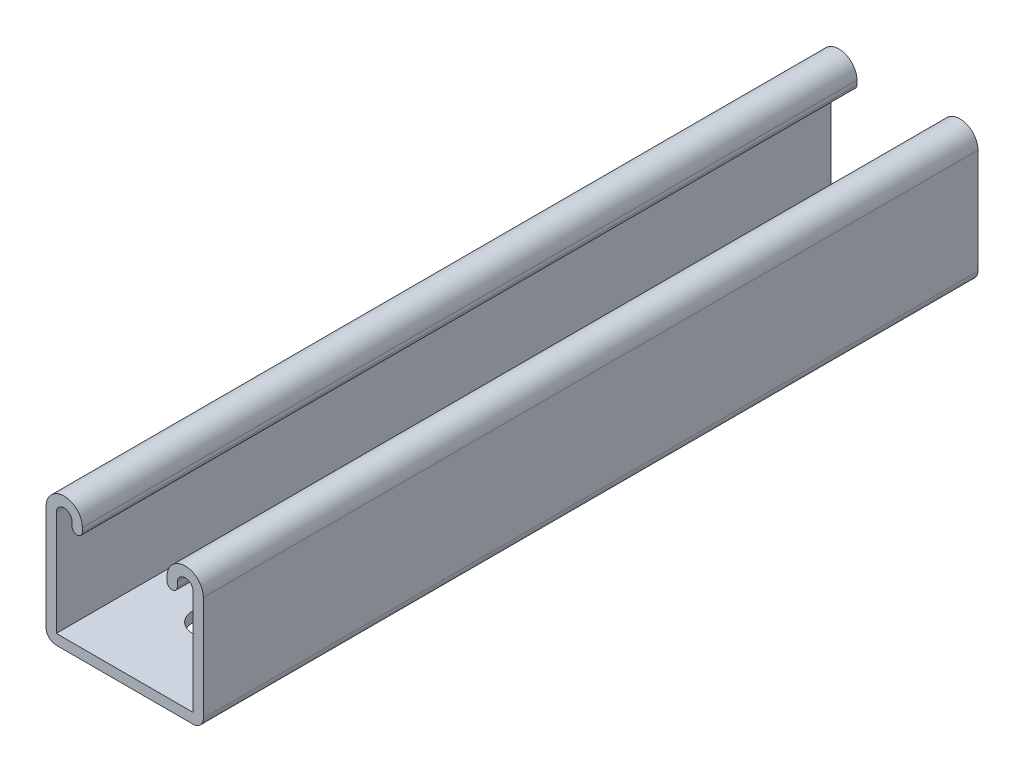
ISO-10303-21;
HEADER;
FILE_DESCRIPTION(('STEP AP214'),'2;1');
FILE_NAME('part.step','',(''),(''),'','','');
FILE_SCHEMA(('AUTOMOTIVE_DESIGN { 1 0 10303 214 1 1 1 1 }'));
ENDSEC;
DATA;
#1=APPLICATION_CONTEXT('core data for automotive mechanical design processes');
#2=APPLICATION_PROTOCOL_DEFINITION('international standard','automotive_design',2000,#1);
#3=PRODUCT_CONTEXT('',#1,'mechanical');
#4=PRODUCT('Part','Part','',(#3));
#5=PRODUCT_RELATED_PRODUCT_CATEGORY('part','',(#4));
#6=PRODUCT_DEFINITION_FORMATION('','',#4);
#7=PRODUCT_DEFINITION_CONTEXT('part definition',#1,'design');
#8=PRODUCT_DEFINITION('design','',#6,#7);
#9=PRODUCT_DEFINITION_SHAPE('','',#8);
#10=(LENGTH_UNIT() NAMED_UNIT(*) SI_UNIT(.MILLI.,.METRE.));
#11=(NAMED_UNIT(*) PLANE_ANGLE_UNIT() SI_UNIT($,.RADIAN.));
#12=(NAMED_UNIT(*) SI_UNIT($,.STERADIAN.) SOLID_ANGLE_UNIT());
#13=UNCERTAINTY_MEASURE_WITH_UNIT(LENGTH_MEASURE(1.E-05),#10,'distance_accuracy_value','');
#14=(GEOMETRIC_REPRESENTATION_CONTEXT(3) GLOBAL_UNCERTAINTY_ASSIGNED_CONTEXT((#13)) GLOBAL_UNIT_ASSIGNED_CONTEXT((#10,
#11,#12)) REPRESENTATION_CONTEXT('',''));
#15=CARTESIAN_POINT('',(0.,0.,0.));
#16=DIRECTION('',(0.,0.,1.));
#17=DIRECTION('',(1.,0.,0.));
#18=AXIS2_PLACEMENT_3D('',#15,#16,#17);
#19=CARTESIAN_POINT('',(-15.875,15.1511,203.2));
#20=DIRECTION('',(0.,0.,-1.));
#21=DIRECTION('',(-1.,0.,0.));
#22=AXIS2_PLACEMENT_3D('',#19,#20,#21);
#23=CYLINDRICAL_SURFACE('',#22,4.7625);
#24=CARTESIAN_POINT('',(-15.875,15.1511,0.));
#25=DIRECTION('',(0.,0.,1.));
#26=DIRECTION('',(-1.,0.,0.));
#27=AXIS2_PLACEMENT_3D('',#24,#25,#26);
#28=CIRCLE('',#27,4.7625);
#29=CARTESIAN_POINT('',(-11.1125,15.1511,0.));
#30=VERTEX_POINT('',#29);
#31=CARTESIAN_POINT('',(-20.6375,15.1511,0.));
#32=VERTEX_POINT('',#31);
#33=EDGE_CURVE('E260',#30,#32,#28,.T.);
#34=ORIENTED_EDGE('',*,*,#33,.T.);
#35=DIRECTION('',(0.,0.,-1.));
#36=VECTOR('',#35,1.);
#37=CARTESIAN_POINT('',(-20.6375,15.1511,203.2));
#38=LINE('',#37,#36);
#39=CARTESIAN_POINT('',(-20.6375,15.1511,203.2));
#40=VERTEX_POINT('',#39);
#41=EDGE_CURVE('E391',#40,#32,#38,.T.);
#42=ORIENTED_EDGE('',*,*,#41,.F.);
#43=CARTESIAN_POINT('',(-15.875,15.1511,203.2));
#44=DIRECTION('',(0.,0.,1.));
#45=DIRECTION('',(-1.,0.,0.));
#46=AXIS2_PLACEMENT_3D('',#43,#44,#45);
#47=CIRCLE('',#46,4.7625);
#48=CARTESIAN_POINT('',(-11.1125,15.1511,203.2));
#49=VERTEX_POINT('',#48);
#50=EDGE_CURVE('E267',#49,#40,#47,.T.);
#51=ORIENTED_EDGE('',*,*,#50,.F.);
#52=DIRECTION('',(0.,0.,-1.));
#53=VECTOR('',#52,1.);
#54=CARTESIAN_POINT('',(-11.1125,15.1511,203.2));
#55=LINE('',#54,#53);
#56=EDGE_CURVE('E305',#49,#30,#55,.T.);
#57=ORIENTED_EDGE('',*,*,#56,.T.);
#58=EDGE_LOOP('',(#34,#42,#51,#57));
#59=FACE_BOUND('',#58,.T.);
#60=ADVANCED_FACE('F39',(#59),#23,.T.);
#61=CARTESIAN_POINT('',(-20.6375,15.1511,203.2));
#62=DIRECTION('',(1.,0.,0.));
#63=DIRECTION('',(0.,1.,0.));
#64=AXIS2_PLACEMENT_3D('',#61,#62,#63);
#65=PLANE('',#64);
#66=DIRECTION('',(0.,-1.,0.));
#67=VECTOR('',#66,1.);
#68=CARTESIAN_POINT('',(-20.6375,15.1511,0.));
#69=LINE('',#68,#67);
#70=CARTESIAN_POINT('',(-20.6375,-12.319,0.));
#71=VERTEX_POINT('',#70);
#72=EDGE_CURVE('E308',#32,#71,#69,.T.);
#73=ORIENTED_EDGE('',*,*,#72,.T.);
#74=DIRECTION('',(0.,0.,-1.));
#75=VECTOR('',#74,1.);
#76=CARTESIAN_POINT('',(-20.6375,-12.319,203.2));
#77=LINE('',#76,#75);
#78=CARTESIAN_POINT('',(-20.6375,-12.319,203.2));
#79=VERTEX_POINT('',#78);
#80=EDGE_CURVE('E388',#79,#71,#77,.T.);
#81=ORIENTED_EDGE('',*,*,#80,.F.);
#82=DIRECTION('',(0.,-1.,0.));
#83=VECTOR('',#82,1.);
#84=CARTESIAN_POINT('',(-20.6375,15.1511,203.2));
#85=LINE('',#84,#83);
#86=EDGE_CURVE('E270',#40,#79,#85,.T.);
#87=ORIENTED_EDGE('',*,*,#86,.F.);
#88=ORIENTED_EDGE('',*,*,#41,.T.);
#89=EDGE_LOOP('',(#73,#81,#87,#88));
#90=FACE_BOUND('',#89,.T.);
#91=ADVANCED_FACE('F433',(#90),#65,.F.);
#92=CARTESIAN_POINT('',(-17.9451,-12.319,203.2));
#93=DIRECTION('',(0.,0.,-1.));
#94=DIRECTION('',(-1.,0.,0.));
#95=AXIS2_PLACEMENT_3D('',#92,#93,#94);
#96=CYLINDRICAL_SURFACE('',#95,2.6924);
#97=CARTESIAN_POINT('',(-17.9451,-12.319,0.));
#98=DIRECTION('',(0.,0.,1.));
#99=DIRECTION('',(-1.,0.,0.));
#100=AXIS2_PLACEMENT_3D('',#97,#98,#99);
#101=CIRCLE('',#100,2.6924);
#102=CARTESIAN_POINT('',(-17.9451,-15.0114,0.));
#103=VERTEX_POINT('',#102);
#104=EDGE_CURVE('E310',#71,#103,#101,.T.);
#105=ORIENTED_EDGE('',*,*,#104,.T.);
#106=DIRECTION('',(0.,0.,-1.));
#107=VECTOR('',#106,1.);
#108=CARTESIAN_POINT('',(-17.9451,-15.0114,203.2));
#109=LINE('',#108,#107);
#110=CARTESIAN_POINT('',(-17.9451,-15.0114,203.2));
#111=VERTEX_POINT('',#110);
#112=EDGE_CURVE('E385',#111,#103,#109,.T.);
#113=ORIENTED_EDGE('',*,*,#112,.F.);
#114=CARTESIAN_POINT('',(-17.9451,-12.319,203.2));
#115=DIRECTION('',(0.,0.,1.));
#116=DIRECTION('',(-1.,0.,0.));
#117=AXIS2_PLACEMENT_3D('',#114,#115,#116);
#118=CIRCLE('',#117,2.6924);
#119=EDGE_CURVE('E273',#79,#111,#118,.T.);
#120=ORIENTED_EDGE('',*,*,#119,.F.);
#121=ORIENTED_EDGE('',*,*,#80,.T.);
#122=EDGE_LOOP('',(#105,#113,#120,#121));
#123=FACE_BOUND('',#122,.T.);
#124=ADVANCED_FACE('F438',(#123),#96,.T.);
#125=CARTESIAN_POINT('',(-17.9451,-15.0114,203.2));
#126=DIRECTION('',(0.,1.,0.));
#127=DIRECTION('',(-1.,0.,0.));
#128=AXIS2_PLACEMENT_3D('',#125,#126,#127);
#129=PLANE('',#128);
#130=DIRECTION('',(0.,0.,-1.));
#131=VECTOR('',#130,1.);
#132=CARTESIAN_POINT('',(-5.159375,-15.0113999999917,114.3));
#133=LINE('',#132,#131);
#134=CARTESIAN_POINT('',(-5.15937500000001,-15.0114,180.18125));
#135=VERTEX_POINT('',#134);
#136=CARTESIAN_POINT('',(-5.159375,-15.0113999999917,114.3));
#137=VERTEX_POINT('',#136);
#138=EDGE_CURVE('E213',#135,#137,#133,.T.);
#139=ORIENTED_EDGE('',*,*,#138,.F.);
#140=CARTESIAN_POINT('',(0.,-15.0113999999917,180.18125));
#141=DIRECTION('',(0.,-1.,0.));
#142=DIRECTION('',(1.,0.,0.));
#143=AXIS2_PLACEMENT_3D('',#140,#141,#142);
#144=CIRCLE('',#143,5.159375);
#145=CARTESIAN_POINT('',(5.159375,-15.0113999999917,180.18125));
#146=VERTEX_POINT('',#145);
#147=EDGE_CURVE('E53',#146,#135,#144,.T.);
#148=ORIENTED_EDGE('',*,*,#147,.F.);
#149=DIRECTION('',(0.,0.,1.));
#150=VECTOR('',#149,1.);
#151=CARTESIAN_POINT('',(5.159375,-15.0113999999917,180.18125));
#152=LINE('',#151,#150);
#153=CARTESIAN_POINT('',(5.159375,-15.0113999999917,114.3));
#154=VERTEX_POINT('',#153);
#155=EDGE_CURVE('E229',#154,#146,#152,.T.);
#156=ORIENTED_EDGE('',*,*,#155,.F.);
#157=CARTESIAN_POINT('',(0.,-15.0113999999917,114.3));
#158=DIRECTION('',(0.,-1.,0.));
#159=DIRECTION('',(1.,0.,0.));
#160=AXIS2_PLACEMENT_3D('',#157,#158,#159);
#161=CIRCLE('',#160,5.159375);
#162=EDGE_CURVE('E223',#137,#154,#161,.T.);
#163=ORIENTED_EDGE('',*,*,#162,.F.);
#164=EDGE_LOOP('',(#139,#148,#156,#163));
#165=FACE_BOUND('',#164,.T.);
#166=DIRECTION('',(0.,0.,-1.));
#167=VECTOR('',#166,1.);
#168=CARTESIAN_POINT('',(-5.159375,-15.0113999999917,12.7));
#169=LINE('',#168,#167);
#170=CARTESIAN_POINT('',(-5.15937500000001,-15.0114,78.58125));
#171=VERTEX_POINT('',#170);
#172=CARTESIAN_POINT('',(-5.159375,-15.0113999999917,12.7));
#173=VERTEX_POINT('',#172);
#174=EDGE_CURVE('E248',#171,#173,#169,.T.);
#175=ORIENTED_EDGE('',*,*,#174,.F.);
#176=CARTESIAN_POINT('',(0.,-15.0113999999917,78.58125));
#177=DIRECTION('',(0.,-1.,0.));
#178=DIRECTION('',(1.,0.,0.));
#179=AXIS2_PLACEMENT_3D('',#176,#177,#178);
#180=CIRCLE('',#179,5.159375);
#181=CARTESIAN_POINT('',(5.159375,-15.0113999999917,78.58125));
#182=VERTEX_POINT('',#181);
#183=EDGE_CURVE('E246',#182,#171,#180,.T.);
#184=ORIENTED_EDGE('',*,*,#183,.F.);
#185=DIRECTION('',(0.,0.,1.));
#186=VECTOR('',#185,1.);
#187=CARTESIAN_POINT('',(5.159375,-15.0113999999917,78.58125));
#188=LINE('',#187,#186);
#189=CARTESIAN_POINT('',(5.159375,-15.0113999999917,12.7));
#190=VERTEX_POINT('',#189);
#191=EDGE_CURVE('E254',#190,#182,#188,.T.);
#192=ORIENTED_EDGE('',*,*,#191,.F.);
#193=CARTESIAN_POINT('',(0.,-15.0113999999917,12.7));
#194=DIRECTION('',(0.,-1.,0.));
#195=DIRECTION('',(1.,0.,0.));
#196=AXIS2_PLACEMENT_3D('',#193,#194,#195);
#197=CIRCLE('',#196,5.159375);
#198=EDGE_CURVE('E251',#173,#190,#197,.T.);
#199=ORIENTED_EDGE('',*,*,#198,.F.);
#200=EDGE_LOOP('',(#175,#184,#192,#199));
#201=FACE_BOUND('',#200,.T.);
#202=DIRECTION('',(1.,0.,0.));
#203=VECTOR('',#202,1.);
#204=CARTESIAN_POINT('',(-17.9451,-15.0114,0.));
#205=LINE('',#204,#203);
#206=CARTESIAN_POINT('',(17.9451,-15.0114,0.));
#207=VERTEX_POINT('',#206);
#208=EDGE_CURVE('E312',#103,#207,#205,.T.);
#209=ORIENTED_EDGE('',*,*,#208,.T.);
#210=DIRECTION('',(0.,0.,-1.));
#211=VECTOR('',#210,1.);
#212=CARTESIAN_POINT('',(17.9451,-15.0114,203.2));
#213=LINE('',#212,#211);
#214=CARTESIAN_POINT('',(17.9451,-15.0114,203.2));
#215=VERTEX_POINT('',#214);
#216=EDGE_CURVE('E382',#215,#207,#213,.T.);
#217=ORIENTED_EDGE('',*,*,#216,.F.);
#218=DIRECTION('',(1.,0.,0.));
#219=VECTOR('',#218,1.);
#220=CARTESIAN_POINT('',(-17.9451,-15.0114,203.2));
#221=LINE('',#220,#219);
#222=EDGE_CURVE('E275',#111,#215,#221,.T.);
#223=ORIENTED_EDGE('',*,*,#222,.F.);
#224=ORIENTED_EDGE('',*,*,#112,.T.);
#225=EDGE_LOOP('',(#209,#217,#223,#224));
#226=FACE_BOUND('',#225,.T.);
#227=ADVANCED_FACE('F227',(#165,#201,#226),#129,.F.);
#228=CARTESIAN_POINT('',(17.9451,-12.319,203.2));
#229=DIRECTION('',(0.,0.,-1.));
#230=DIRECTION('',(-1.,0.,0.));
#231=AXIS2_PLACEMENT_3D('',#228,#229,#230);
#232=CYLINDRICAL_SURFACE('',#231,2.6924);
#233=CARTESIAN_POINT('',(17.9451,-12.319,0.));
#234=DIRECTION('',(0.,0.,1.));
#235=DIRECTION('',(1.,0.,0.));
#236=AXIS2_PLACEMENT_3D('',#233,#234,#235);
#237=CIRCLE('',#236,2.6924);
#238=CARTESIAN_POINT('',(20.6375,-12.319,0.));
#239=VERTEX_POINT('',#238);
#240=EDGE_CURVE('E314',#207,#239,#237,.T.);
#241=ORIENTED_EDGE('',*,*,#240,.T.);
#242=DIRECTION('',(0.,0.,-1.));
#243=VECTOR('',#242,1.);
#244=CARTESIAN_POINT('',(20.6375,-12.319,203.2));
#245=LINE('',#244,#243);
#246=CARTESIAN_POINT('',(20.6375,-12.319,203.2));
#247=VERTEX_POINT('',#246);
#248=EDGE_CURVE('E379',#247,#239,#245,.T.);
#249=ORIENTED_EDGE('',*,*,#248,.F.);
#250=CARTESIAN_POINT('',(17.9451,-12.319,203.2));
#251=DIRECTION('',(0.,0.,1.));
#252=DIRECTION('',(1.,0.,0.));
#253=AXIS2_PLACEMENT_3D('',#250,#251,#252);
#254=CIRCLE('',#253,2.6924);
#255=EDGE_CURVE('E277',#215,#247,#254,.T.);
#256=ORIENTED_EDGE('',*,*,#255,.F.);
#257=ORIENTED_EDGE('',*,*,#216,.T.);
#258=EDGE_LOOP('',(#241,#249,#256,#257));
#259=FACE_BOUND('',#258,.T.);
#260=ADVANCED_FACE('F518',(#259),#232,.T.);
#261=CARTESIAN_POINT('',(20.6375,-12.319,203.2));
#262=DIRECTION('',(-1.,0.,0.));
#263=DIRECTION('',(0.,0.,1.));
#264=AXIS2_PLACEMENT_3D('',#261,#262,#263);
#265=PLANE('',#264);
#266=DIRECTION('',(0.,1.,0.));
#267=VECTOR('',#266,1.);
#268=CARTESIAN_POINT('',(20.6375,-12.319,0.));
#269=LINE('',#268,#267);
#270=CARTESIAN_POINT('',(20.6375,15.1511,0.));
#271=VERTEX_POINT('',#270);
#272=EDGE_CURVE('E316',#239,#271,#269,.T.);
#273=ORIENTED_EDGE('',*,*,#272,.T.);
#274=DIRECTION('',(0.,0.,-1.));
#275=VECTOR('',#274,1.);
#276=CARTESIAN_POINT('',(20.6375,15.1511,203.2));
#277=LINE('',#276,#275);
#278=CARTESIAN_POINT('',(20.6375,15.1511,203.2));
#279=VERTEX_POINT('',#278);
#280=EDGE_CURVE('E376',#279,#271,#277,.T.);
#281=ORIENTED_EDGE('',*,*,#280,.F.);
#282=DIRECTION('',(0.,1.,0.));
#283=VECTOR('',#282,1.);
#284=CARTESIAN_POINT('',(20.6375,-12.319,203.2));
#285=LINE('',#284,#283);
#286=EDGE_CURVE('E279',#247,#279,#285,.T.);
#287=ORIENTED_EDGE('',*,*,#286,.F.);
#288=ORIENTED_EDGE('',*,*,#248,.T.);
#289=EDGE_LOOP('',(#273,#281,#287,#288));
#290=FACE_BOUND('',#289,.T.);
#291=ADVANCED_FACE('F514',(#290),#265,.F.);
#292=CARTESIAN_POINT('',(15.875,15.1511,203.2));
#293=DIRECTION('',(0.,0.,-1.));
#294=DIRECTION('',(-1.,0.,0.));
#295=AXIS2_PLACEMENT_3D('',#292,#293,#294);
#296=CYLINDRICAL_SURFACE('',#295,4.7625);
#297=CARTESIAN_POINT('',(15.875,15.1511,0.));
#298=DIRECTION('',(0.,0.,1.));
#299=DIRECTION('',(1.,0.,0.));
#300=AXIS2_PLACEMENT_3D('',#297,#298,#299);
#301=CIRCLE('',#300,4.7625);
#302=CARTESIAN_POINT('',(11.1125,15.1511,0.));
#303=VERTEX_POINT('',#302);
#304=EDGE_CURVE('E318',#271,#303,#301,.T.);
#305=ORIENTED_EDGE('',*,*,#304,.T.);
#306=DIRECTION('',(0.,0.,-1.));
#307=VECTOR('',#306,1.);
#308=CARTESIAN_POINT('',(11.1125,15.1511,203.2));
#309=LINE('',#308,#307);
#310=CARTESIAN_POINT('',(11.1125,15.1511,203.2));
#311=VERTEX_POINT('',#310);
#312=EDGE_CURVE('E373',#311,#303,#309,.T.);
#313=ORIENTED_EDGE('',*,*,#312,.F.);
#314=CARTESIAN_POINT('',(15.875,15.1511,203.2));
#315=DIRECTION('',(0.,0.,1.));
#316=DIRECTION('',(1.,0.,0.));
#317=AXIS2_PLACEMENT_3D('',#314,#315,#316);
#318=CIRCLE('',#317,4.7625);
#319=EDGE_CURVE('E281',#279,#311,#318,.T.);
#320=ORIENTED_EDGE('',*,*,#319,.F.);
#321=ORIENTED_EDGE('',*,*,#280,.T.);
#322=EDGE_LOOP('',(#305,#313,#320,#321));
#323=FACE_BOUND('',#322,.T.);
#324=ADVANCED_FACE('F509',(#323),#296,.T.);
#325=CARTESIAN_POINT('',(11.1125,15.1511,203.2));
#326=DIRECTION('',(1.,0.,0.));
#327=DIRECTION('',(0.,1.,0.));
#328=AXIS2_PLACEMENT_3D('',#325,#326,#327);
#329=PLANE('',#328);
#330=DIRECTION('',(0.,-1.,0.));
#331=VECTOR('',#330,1.);
#332=CARTESIAN_POINT('',(11.1125,15.1511,0.));
#333=LINE('',#332,#331);
#334=CARTESIAN_POINT('',(11.1125,14.11605,0.));
#335=VERTEX_POINT('',#334);
#336=EDGE_CURVE('E320',#303,#335,#333,.T.);
#337=ORIENTED_EDGE('',*,*,#336,.T.);
#338=DIRECTION('',(0.,0.,-1.));
#339=VECTOR('',#338,1.);
#340=CARTESIAN_POINT('',(11.1125,14.11605,203.2));
#341=LINE('',#340,#339);
#342=CARTESIAN_POINT('',(11.1125,14.11605,203.2));
#343=VERTEX_POINT('',#342);
#344=EDGE_CURVE('E370',#343,#335,#341,.T.);
#345=ORIENTED_EDGE('',*,*,#344,.F.);
#346=DIRECTION('',(0.,-1.,0.));
#347=VECTOR('',#346,1.);
#348=CARTESIAN_POINT('',(11.1125,15.1511,203.2));
#349=LINE('',#348,#347);
#350=EDGE_CURVE('E283',#311,#343,#349,.T.);
#351=ORIENTED_EDGE('',*,*,#350,.F.);
#352=ORIENTED_EDGE('',*,*,#312,.T.);
#353=EDGE_LOOP('',(#337,#345,#351,#352));
#354=FACE_BOUND('',#353,.T.);
#355=ADVANCED_FACE('F503',(#354),#329,.F.);
#356=CARTESIAN_POINT('',(12.4587,14.11605,203.2));
#357=DIRECTION('',(0.,0.,-1.));
#358=DIRECTION('',(-1.,0.,0.));
#359=AXIS2_PLACEMENT_3D('',#356,#357,#358);
#360=CYLINDRICAL_SURFACE('',#359,1.3462);
#361=CARTESIAN_POINT('',(12.4587,14.11605,0.));
#362=DIRECTION('',(0.,0.,1.));
#363=DIRECTION('',(1.,0.,0.));
#364=AXIS2_PLACEMENT_3D('',#361,#362,#363);
#365=CIRCLE('',#364,1.3462);
#366=CARTESIAN_POINT('',(13.8049,14.11605,0.));
#367=VERTEX_POINT('',#366);
#368=EDGE_CURVE('E322',#335,#367,#365,.T.);
#369=ORIENTED_EDGE('',*,*,#368,.T.);
#370=DIRECTION('',(0.,0.,-1.));
#371=VECTOR('',#370,1.);
#372=CARTESIAN_POINT('',(13.8049,14.11605,203.2));
#373=LINE('',#372,#371);
#374=CARTESIAN_POINT('',(13.8049,14.11605,203.2));
#375=VERTEX_POINT('',#374);
#376=EDGE_CURVE('E367',#375,#367,#373,.T.);
#377=ORIENTED_EDGE('',*,*,#376,.F.);
#378=CARTESIAN_POINT('',(12.4587,14.11605,203.2));
#379=DIRECTION('',(0.,0.,1.));
#380=DIRECTION('',(1.,0.,0.));
#381=AXIS2_PLACEMENT_3D('',#378,#379,#380);
#382=CIRCLE('',#381,1.3462);
#383=EDGE_CURVE('E285',#343,#375,#382,.T.);
#384=ORIENTED_EDGE('',*,*,#383,.F.);
#385=ORIENTED_EDGE('',*,*,#344,.T.);
#386=EDGE_LOOP('',(#369,#377,#384,#385));
#387=FACE_BOUND('',#386,.T.);
#388=ADVANCED_FACE('F499',(#387),#360,.T.);
#389=CARTESIAN_POINT('',(13.8049,15.1511,203.2));
#390=DIRECTION('',(-1.,0.,0.));
#391=DIRECTION('',(0.,0.,1.));
#392=AXIS2_PLACEMENT_3D('',#389,#390,#391);
#393=PLANE('',#392);
#394=DIRECTION('',(0.,1.,0.));
#395=VECTOR('',#394,1.);
#396=CARTESIAN_POINT('',(13.8049,15.1511,0.));
#397=LINE('',#396,#395);
#398=CARTESIAN_POINT('',(13.8049,15.1511,0.));
#399=VERTEX_POINT('',#398);
#400=EDGE_CURVE('E324',#367,#399,#397,.T.);
#401=ORIENTED_EDGE('',*,*,#400,.T.);
#402=DIRECTION('',(0.,0.,-1.));
#403=VECTOR('',#402,1.);
#404=CARTESIAN_POINT('',(13.8049,15.1511,203.2));
#405=LINE('',#404,#403);
#406=CARTESIAN_POINT('',(13.8049,15.1511,203.2));
#407=VERTEX_POINT('',#406);
#408=EDGE_CURVE('E364',#407,#399,#405,.T.);
#409=ORIENTED_EDGE('',*,*,#408,.F.);
#410=DIRECTION('',(0.,1.,0.));
#411=VECTOR('',#410,1.);
#412=CARTESIAN_POINT('',(13.8049,15.1511,203.2));
#413=LINE('',#412,#411);
#414=EDGE_CURVE('E287',#375,#407,#413,.T.);
#415=ORIENTED_EDGE('',*,*,#414,.F.);
#416=ORIENTED_EDGE('',*,*,#376,.T.);
#417=EDGE_LOOP('',(#401,#409,#415,#416));
#418=FACE_BOUND('',#417,.T.);
#419=ADVANCED_FACE('F494',(#418),#393,.F.);
#420=CARTESIAN_POINT('',(15.875,15.1511,203.2));
#421=DIRECTION('',(0.,0.,-1.));
#422=DIRECTION('',(-1.,0.,0.));
#423=AXIS2_PLACEMENT_3D('',#420,#421,#422);
#424=CYLINDRICAL_SURFACE('',#423,2.0701);
#425=CARTESIAN_POINT('',(15.875,15.1511,0.));
#426=DIRECTION('',(0.,0.,-1.));
#427=DIRECTION('',(1.,0.,0.));
#428=AXIS2_PLACEMENT_3D('',#425,#426,#427);
#429=CIRCLE('',#428,2.0701);
#430=CARTESIAN_POINT('',(17.9451,15.1511,0.));
#431=VERTEX_POINT('',#430);
#432=EDGE_CURVE('E326',#399,#431,#429,.T.);
#433=ORIENTED_EDGE('',*,*,#432,.T.);
#434=DIRECTION('',(0.,0.,-1.));
#435=VECTOR('',#434,1.);
#436=CARTESIAN_POINT('',(17.9451,15.1511,203.2));
#437=LINE('',#436,#435);
#438=CARTESIAN_POINT('',(17.9451,15.1511,203.2));
#439=VERTEX_POINT('',#438);
#440=EDGE_CURVE('E361',#439,#431,#437,.T.);
#441=ORIENTED_EDGE('',*,*,#440,.F.);
#442=CARTESIAN_POINT('',(15.875,15.1511,203.2));
#443=DIRECTION('',(0.,0.,-1.));
#444=DIRECTION('',(1.,0.,0.));
#445=AXIS2_PLACEMENT_3D('',#442,#443,#444);
#446=CIRCLE('',#445,2.0701);
#447=EDGE_CURVE('E289',#407,#439,#446,.T.);
#448=ORIENTED_EDGE('',*,*,#447,.F.);
#449=ORIENTED_EDGE('',*,*,#408,.T.);
#450=EDGE_LOOP('',(#433,#441,#448,#449));
#451=FACE_BOUND('',#450,.T.);
#452=ADVANCED_FACE('F488',(#451),#424,.F.);
#453=CARTESIAN_POINT('',(17.9451,-12.319,203.2));
#454=DIRECTION('',(1.,0.,0.));
#455=DIRECTION('',(0.,1.,0.));
#456=AXIS2_PLACEMENT_3D('',#453,#454,#455);
#457=PLANE('',#456);
#458=DIRECTION('',(0.,-1.,0.));
#459=VECTOR('',#458,1.);
#460=CARTESIAN_POINT('',(17.9451,-12.319,0.));
#461=LINE('',#460,#459);
#462=CARTESIAN_POINT('',(17.9451,-12.319,0.));
#463=VERTEX_POINT('',#462);
#464=EDGE_CURVE('E328',#431,#463,#461,.T.);
#465=ORIENTED_EDGE('',*,*,#464,.T.);
#466=DIRECTION('',(0.,0.,-1.));
#467=VECTOR('',#466,1.);
#468=CARTESIAN_POINT('',(17.9451,-12.319,203.2));
#469=LINE('',#468,#467);
#470=CARTESIAN_POINT('',(17.9451,-12.319,203.2));
#471=VERTEX_POINT('',#470);
#472=EDGE_CURVE('E358',#471,#463,#469,.T.);
#473=ORIENTED_EDGE('',*,*,#472,.F.);
#474=DIRECTION('',(0.,-1.,0.));
#475=VECTOR('',#474,1.);
#476=CARTESIAN_POINT('',(17.9451,-12.319,203.2));
#477=LINE('',#476,#475);
#478=EDGE_CURVE('E291',#439,#471,#477,.T.);
#479=ORIENTED_EDGE('',*,*,#478,.F.);
#480=ORIENTED_EDGE('',*,*,#440,.T.);
#481=EDGE_LOOP('',(#465,#473,#479,#480));
#482=FACE_BOUND('',#481,.T.);
#483=ADVANCED_FACE('F484',(#482),#457,.F.);
#484=CARTESIAN_POINT('',(-17.9451,-12.319,203.2));
#485=DIRECTION('',(0.,-1.,0.));
#486=DIRECTION('',(0.,0.,-1.));
#487=AXIS2_PLACEMENT_3D('',#484,#485,#486);
#488=PLANE('',#487);
#489=DIRECTION('',(0.,0.,1.));
#490=VECTOR('',#489,1.);
#491=CARTESIAN_POINT('',(5.15937499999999,-12.319,304.8));
#492=LINE('',#491,#490);
#493=CARTESIAN_POINT('',(5.159375,-12.319,114.3));
#494=VERTEX_POINT('',#493);
#495=CARTESIAN_POINT('',(5.159375,-12.319,180.18125));
#496=VERTEX_POINT('',#495);
#497=EDGE_CURVE('E239',#494,#496,#492,.T.);
#498=ORIENTED_EDGE('',*,*,#497,.T.);
#499=CARTESIAN_POINT('',(0.,-12.319,180.18125));
#500=DIRECTION('',(0.,-1.,0.));
#501=DIRECTION('',(0.,0.,-1.));
#502=AXIS2_PLACEMENT_3D('',#499,#500,#501);
#503=CIRCLE('',#502,5.159375);
#504=CARTESIAN_POINT('',(-5.15937500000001,-12.319,180.18125));
#505=VERTEX_POINT('',#504);
#506=EDGE_CURVE('E243',#496,#505,#503,.T.);
#507=ORIENTED_EDGE('',*,*,#506,.T.);
#508=DIRECTION('',(0.,0.,-1.));
#509=VECTOR('',#508,1.);
#510=CARTESIAN_POINT('',(-5.15937500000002,-12.319,304.8));
#511=LINE('',#510,#509);
#512=CARTESIAN_POINT('',(-5.159375,-12.319,114.3));
#513=VERTEX_POINT('',#512);
#514=EDGE_CURVE('E220',#505,#513,#511,.T.);
#515=ORIENTED_EDGE('',*,*,#514,.T.);
#516=CARTESIAN_POINT('',(0.,-12.319,114.3));
#517=DIRECTION('',(0.,-1.,0.));
#518=DIRECTION('',(0.,0.,-1.));
#519=AXIS2_PLACEMENT_3D('',#516,#517,#518);
#520=CIRCLE('',#519,5.159375);
#521=EDGE_CURVE('E61',#513,#494,#520,.T.);
#522=ORIENTED_EDGE('',*,*,#521,.T.);
#523=EDGE_LOOP('',(#498,#507,#515,#522));
#524=FACE_BOUND('',#523,.T.);
#525=DIRECTION('',(0.,0.,1.));
#526=VECTOR('',#525,1.);
#527=CARTESIAN_POINT('',(5.15937499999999,-12.319,203.2));
#528=LINE('',#527,#526);
#529=CARTESIAN_POINT('',(5.159375,-12.319,12.7));
#530=VERTEX_POINT('',#529);
#531=CARTESIAN_POINT('',(5.159375,-12.319,78.58125));
#532=VERTEX_POINT('',#531);
#533=EDGE_CURVE('E46',#530,#532,#528,.T.);
#534=ORIENTED_EDGE('',*,*,#533,.T.);
#535=CARTESIAN_POINT('',(0.,-12.319,78.58125));
#536=DIRECTION('',(0.,-1.,0.));
#537=DIRECTION('',(0.,0.,-1.));
#538=AXIS2_PLACEMENT_3D('',#535,#536,#537);
#539=CIRCLE('',#538,5.159375);
#540=CARTESIAN_POINT('',(-5.15937500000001,-12.319,78.58125));
#541=VERTEX_POINT('',#540);
#542=EDGE_CURVE('E11',#532,#541,#539,.T.);
#543=ORIENTED_EDGE('',*,*,#542,.T.);
#544=DIRECTION('',(0.,0.,-1.));
#545=VECTOR('',#544,1.);
#546=CARTESIAN_POINT('',(-5.15937500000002,-12.319,203.2));
#547=LINE('',#546,#545);
#548=CARTESIAN_POINT('',(-5.159375,-12.319,12.7));
#549=VERTEX_POINT('',#548);
#550=EDGE_CURVE('E394',#541,#549,#547,.T.);
#551=ORIENTED_EDGE('',*,*,#550,.T.);
#552=CARTESIAN_POINT('',(0.,-12.319,12.7));
#553=DIRECTION('',(0.,-1.,0.));
#554=DIRECTION('',(0.,0.,-1.));
#555=AXIS2_PLACEMENT_3D('',#552,#553,#554);
#556=CIRCLE('',#555,5.159375);
#557=EDGE_CURVE('E397',#549,#530,#556,.T.);
#558=ORIENTED_EDGE('',*,*,#557,.T.);
#559=EDGE_LOOP('',(#534,#543,#551,#558));
#560=FACE_BOUND('',#559,.T.);
#561=DIRECTION('',(-1.,0.,0.));
#562=VECTOR('',#561,1.);
#563=CARTESIAN_POINT('',(-17.9451,-12.319,0.));
#564=LINE('',#563,#562);
#565=CARTESIAN_POINT('',(-17.9451,-12.319,0.));
#566=VERTEX_POINT('',#565);
#567=EDGE_CURVE('E330',#463,#566,#564,.T.);
#568=ORIENTED_EDGE('',*,*,#567,.T.);
#569=DIRECTION('',(0.,0.,-1.));
#570=VECTOR('',#569,1.);
#571=CARTESIAN_POINT('',(-17.9451,-12.319,203.2));
#572=LINE('',#571,#570);
#573=CARTESIAN_POINT('',(-17.9451,-12.319,203.2));
#574=VERTEX_POINT('',#573);
#575=EDGE_CURVE('E355',#574,#566,#572,.T.);
#576=ORIENTED_EDGE('',*,*,#575,.F.);
#577=DIRECTION('',(-1.,0.,0.));
#578=VECTOR('',#577,1.);
#579=CARTESIAN_POINT('',(-17.9451,-12.319,203.2));
#580=LINE('',#579,#578);
#581=EDGE_CURVE('E293',#471,#574,#580,.T.);
#582=ORIENTED_EDGE('',*,*,#581,.F.);
#583=ORIENTED_EDGE('',*,*,#472,.T.);
#584=EDGE_LOOP('',(#568,#576,#582,#583));
#585=FACE_BOUND('',#584,.T.);
#586=ADVANCED_FACE('F401',(#524,#560,#585),#488,.F.);
#587=CARTESIAN_POINT('',(-17.9451,15.1511,203.2));
#588=DIRECTION('',(-1.,0.,0.));
#589=DIRECTION('',(0.,0.,1.));
#590=AXIS2_PLACEMENT_3D('',#587,#588,#589);
#591=PLANE('',#590);
#592=DIRECTION('',(0.,1.,0.));
#593=VECTOR('',#592,1.);
#594=CARTESIAN_POINT('',(-17.9451,15.1511,0.));
#595=LINE('',#594,#593);
#596=CARTESIAN_POINT('',(-17.9451,15.1511,0.));
#597=VERTEX_POINT('',#596);
#598=EDGE_CURVE('E332',#566,#597,#595,.T.);
#599=ORIENTED_EDGE('',*,*,#598,.T.);
#600=DIRECTION('',(0.,0.,-1.));
#601=VECTOR('',#600,1.);
#602=CARTESIAN_POINT('',(-17.9451,15.1511,203.2));
#603=LINE('',#602,#601);
#604=CARTESIAN_POINT('',(-17.9451,15.1511,203.2));
#605=VERTEX_POINT('',#604);
#606=EDGE_CURVE('E352',#605,#597,#603,.T.);
#607=ORIENTED_EDGE('',*,*,#606,.F.);
#608=DIRECTION('',(0.,1.,0.));
#609=VECTOR('',#608,1.);
#610=CARTESIAN_POINT('',(-17.9451,15.1511,203.2));
#611=LINE('',#610,#609);
#612=EDGE_CURVE('E295',#574,#605,#611,.T.);
#613=ORIENTED_EDGE('',*,*,#612,.F.);
#614=ORIENTED_EDGE('',*,*,#575,.T.);
#615=EDGE_LOOP('',(#599,#607,#613,#614));
#616=FACE_BOUND('',#615,.T.);
#617=ADVANCED_FACE('F475',(#616),#591,.F.);
#618=CARTESIAN_POINT('',(-15.875,15.1511,203.2));
#619=DIRECTION('',(0.,0.,-1.));
#620=DIRECTION('',(-1.,0.,0.));
#621=AXIS2_PLACEMENT_3D('',#618,#619,#620);
#622=CYLINDRICAL_SURFACE('',#621,2.0701);
#623=CARTESIAN_POINT('',(-15.875,15.1511,0.));
#624=DIRECTION('',(0.,0.,-1.));
#625=DIRECTION('',(-1.,0.,0.));
#626=AXIS2_PLACEMENT_3D('',#623,#624,#625);
#627=CIRCLE('',#626,2.0701);
#628=CARTESIAN_POINT('',(-13.8049,15.1511,0.));
#629=VERTEX_POINT('',#628);
#630=EDGE_CURVE('E334',#597,#629,#627,.T.);
#631=ORIENTED_EDGE('',*,*,#630,.T.);
#632=DIRECTION('',(0.,0.,-1.));
#633=VECTOR('',#632,1.);
#634=CARTESIAN_POINT('',(-13.8049,15.1511,203.2));
#635=LINE('',#634,#633);
#636=CARTESIAN_POINT('',(-13.8049,15.1511,203.2));
#637=VERTEX_POINT('',#636);
#638=EDGE_CURVE('E349',#637,#629,#635,.T.);
#639=ORIENTED_EDGE('',*,*,#638,.F.);
#640=CARTESIAN_POINT('',(-15.875,15.1511,203.2));
#641=DIRECTION('',(0.,0.,-1.));
#642=DIRECTION('',(-1.,0.,0.));
#643=AXIS2_PLACEMENT_3D('',#640,#641,#642);
#644=CIRCLE('',#643,2.0701);
#645=EDGE_CURVE('E297',#605,#637,#644,.T.);
#646=ORIENTED_EDGE('',*,*,#645,.F.);
#647=ORIENTED_EDGE('',*,*,#606,.T.);
#648=EDGE_LOOP('',(#631,#639,#646,#647));
#649=FACE_BOUND('',#648,.T.);
#650=ADVANCED_FACE('F471',(#649),#622,.F.);
#651=CARTESIAN_POINT('',(-13.8049,15.1511,203.2));
#652=DIRECTION('',(1.,0.,0.));
#653=DIRECTION('',(0.,1.,0.));
#654=AXIS2_PLACEMENT_3D('',#651,#652,#653);
#655=PLANE('',#654);
#656=DIRECTION('',(0.,-1.,0.));
#657=VECTOR('',#656,1.);
#658=CARTESIAN_POINT('',(-13.8049,15.1511,0.));
#659=LINE('',#658,#657);
#660=CARTESIAN_POINT('',(-13.8049,14.11605,0.));
#661=VERTEX_POINT('',#660);
#662=EDGE_CURVE('E336',#629,#661,#659,.T.);
#663=ORIENTED_EDGE('',*,*,#662,.T.);
#664=DIRECTION('',(0.,0.,-1.));
#665=VECTOR('',#664,1.);
#666=CARTESIAN_POINT('',(-13.8049,14.11605,203.2));
#667=LINE('',#666,#665);
#668=CARTESIAN_POINT('',(-13.8049,14.11605,203.2));
#669=VERTEX_POINT('',#668);
#670=EDGE_CURVE('E346',#669,#661,#667,.T.);
#671=ORIENTED_EDGE('',*,*,#670,.F.);
#672=DIRECTION('',(0.,-1.,0.));
#673=VECTOR('',#672,1.);
#674=CARTESIAN_POINT('',(-13.8049,15.1511,203.2));
#675=LINE('',#674,#673);
#676=EDGE_CURVE('E299',#637,#669,#675,.T.);
#677=ORIENTED_EDGE('',*,*,#676,.F.);
#678=ORIENTED_EDGE('',*,*,#638,.T.);
#679=EDGE_LOOP('',(#663,#671,#677,#678));
#680=FACE_BOUND('',#679,.T.);
#681=ADVANCED_FACE('F466',(#680),#655,.F.);
#682=CARTESIAN_POINT('',(-12.4587,14.11605,203.2));
#683=DIRECTION('',(0.,0.,-1.));
#684=DIRECTION('',(-1.,0.,0.));
#685=AXIS2_PLACEMENT_3D('',#682,#683,#684);
#686=CYLINDRICAL_SURFACE('',#685,1.3462);
#687=CARTESIAN_POINT('',(-12.4587,14.11605,0.));
#688=DIRECTION('',(0.,0.,1.));
#689=DIRECTION('',(-1.,0.,0.));
#690=AXIS2_PLACEMENT_3D('',#687,#688,#689);
#691=CIRCLE('',#690,1.3462);
#692=CARTESIAN_POINT('',(-11.1125,14.11605,0.));
#693=VERTEX_POINT('',#692);
#694=EDGE_CURVE('E338',#661,#693,#691,.T.);
#695=ORIENTED_EDGE('',*,*,#694,.T.);
#696=DIRECTION('',(0.,0.,-1.));
#697=VECTOR('',#696,1.);
#698=CARTESIAN_POINT('',(-11.1125,14.11605,203.2));
#699=LINE('',#698,#697);
#700=CARTESIAN_POINT('',(-11.1125,14.11605,203.2));
#701=VERTEX_POINT('',#700);
#702=EDGE_CURVE('E343',#701,#693,#699,.T.);
#703=ORIENTED_EDGE('',*,*,#702,.F.);
#704=CARTESIAN_POINT('',(-12.4587,14.11605,203.2));
#705=DIRECTION('',(0.,0.,1.));
#706=DIRECTION('',(-1.,0.,0.));
#707=AXIS2_PLACEMENT_3D('',#704,#705,#706);
#708=CIRCLE('',#707,1.3462);
#709=EDGE_CURVE('E301',#669,#701,#708,.T.);
#710=ORIENTED_EDGE('',*,*,#709,.F.);
#711=ORIENTED_EDGE('',*,*,#670,.T.);
#712=EDGE_LOOP('',(#695,#703,#710,#711));
#713=FACE_BOUND('',#712,.T.);
#714=ADVANCED_FACE('F460',(#713),#686,.T.);
#715=CARTESIAN_POINT('',(-11.1125,15.1511,203.2));
#716=DIRECTION('',(-1.,0.,0.));
#717=DIRECTION('',(0.,0.,1.));
#718=AXIS2_PLACEMENT_3D('',#715,#716,#717);
#719=PLANE('',#718);
#720=DIRECTION('',(0.,1.,0.));
#721=VECTOR('',#720,1.);
#722=CARTESIAN_POINT('',(-11.1125,15.1511,0.));
#723=LINE('',#722,#721);
#724=EDGE_CURVE('E271',#693,#30,#723,.T.);
#725=ORIENTED_EDGE('',*,*,#724,.T.);
#726=ORIENTED_EDGE('',*,*,#56,.F.);
#727=DIRECTION('',(0.,1.,0.));
#728=VECTOR('',#727,1.);
#729=CARTESIAN_POINT('',(-11.1125,15.1511,203.2));
#730=LINE('',#729,#728);
#731=EDGE_CURVE('E303',#701,#49,#730,.T.);
#732=ORIENTED_EDGE('',*,*,#731,.F.);
#733=ORIENTED_EDGE('',*,*,#702,.T.);
#734=EDGE_LOOP('',(#725,#726,#732,#733));
#735=FACE_BOUND('',#734,.T.);
#736=ADVANCED_FACE('F458',(#735),#719,.F.);
#737=CARTESIAN_POINT('',(-15.875,15.1511,203.2));
#738=DIRECTION('',(0.,0.,-1.));
#739=DIRECTION('',(-1.,0.,0.));
#740=AXIS2_PLACEMENT_3D('',#737,#738,#739);
#741=PLANE('',#740);
#742=ORIENTED_EDGE('',*,*,#50,.T.);
#743=ORIENTED_EDGE('',*,*,#86,.T.);
#744=ORIENTED_EDGE('',*,*,#119,.T.);
#745=ORIENTED_EDGE('',*,*,#222,.T.);
#746=ORIENTED_EDGE('',*,*,#255,.T.);
#747=ORIENTED_EDGE('',*,*,#286,.T.);
#748=ORIENTED_EDGE('',*,*,#319,.T.);
#749=ORIENTED_EDGE('',*,*,#350,.T.);
#750=ORIENTED_EDGE('',*,*,#383,.T.);
#751=ORIENTED_EDGE('',*,*,#414,.T.);
#752=ORIENTED_EDGE('',*,*,#447,.T.);
#753=ORIENTED_EDGE('',*,*,#478,.T.);
#754=ORIENTED_EDGE('',*,*,#581,.T.);
#755=ORIENTED_EDGE('',*,*,#612,.T.);
#756=ORIENTED_EDGE('',*,*,#645,.T.);
#757=ORIENTED_EDGE('',*,*,#676,.T.);
#758=ORIENTED_EDGE('',*,*,#709,.T.);
#759=ORIENTED_EDGE('',*,*,#731,.T.);
#760=EDGE_LOOP('',(#742,#743,#744,#745,#746,#747,#748,#749,#750,#751,#752,#753,#754,#755,#756,
#757,#758,#759));
#761=FACE_BOUND('',#760,.T.);
#762=ADVANCED_FACE('F453',(#761),#741,.F.);
#763=CARTESIAN_POINT('',(-15.875,15.1511,0.));
#764=DIRECTION('',(0.,0.,-1.));
#765=DIRECTION('',(-1.,0.,0.));
#766=AXIS2_PLACEMENT_3D('',#763,#764,#765);
#767=PLANE('',#766);
#768=ORIENTED_EDGE('',*,*,#33,.F.);
#769=ORIENTED_EDGE('',*,*,#724,.F.);
#770=ORIENTED_EDGE('',*,*,#694,.F.);
#771=ORIENTED_EDGE('',*,*,#662,.F.);
#772=ORIENTED_EDGE('',*,*,#630,.F.);
#773=ORIENTED_EDGE('',*,*,#598,.F.);
#774=ORIENTED_EDGE('',*,*,#567,.F.);
#775=ORIENTED_EDGE('',*,*,#464,.F.);
#776=ORIENTED_EDGE('',*,*,#432,.F.);
#777=ORIENTED_EDGE('',*,*,#400,.F.);
#778=ORIENTED_EDGE('',*,*,#368,.F.);
#779=ORIENTED_EDGE('',*,*,#336,.F.);
#780=ORIENTED_EDGE('',*,*,#304,.F.);
#781=ORIENTED_EDGE('',*,*,#272,.F.);
#782=ORIENTED_EDGE('',*,*,#240,.F.);
#783=ORIENTED_EDGE('',*,*,#208,.F.);
#784=ORIENTED_EDGE('',*,*,#104,.F.);
#785=ORIENTED_EDGE('',*,*,#72,.F.);
#786=EDGE_LOOP('',(#768,#769,#770,#771,#772,#773,#774,#775,#776,#777,#778,#779,#780,#781,#782,
#783,#784,#785));
#787=FACE_BOUND('',#786,.T.);
#788=ADVANCED_FACE('F446',(#787),#767,.T.);
#789=CARTESIAN_POINT('',(0.,19.9136,78.58125));
#790=DIRECTION('',(0.,-1.,0.));
#791=DIRECTION('',(1.,0.,0.));
#792=AXIS2_PLACEMENT_3D('',#789,#790,#791);
#793=CYLINDRICAL_SURFACE('',#792,5.159375);
#794=DIRECTION('',(0.,-1.,0.));
#795=VECTOR('',#794,1.);
#796=CARTESIAN_POINT('',(5.159375,19.9136,78.58125));
#797=LINE('',#796,#795);
#798=EDGE_CURVE('E258',#532,#182,#797,.T.);
#799=ORIENTED_EDGE('',*,*,#798,.T.);
#800=ORIENTED_EDGE('',*,*,#183,.T.);
#801=DIRECTION('',(0.,-1.,0.));
#802=VECTOR('',#801,1.);
#803=CARTESIAN_POINT('',(-5.15937500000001,19.9136,78.58125));
#804=LINE('',#803,#802);
#805=EDGE_CURVE('E257',#541,#171,#804,.T.);
#806=ORIENTED_EDGE('',*,*,#805,.F.);
#807=ORIENTED_EDGE('',*,*,#542,.F.);
#808=EDGE_LOOP('',(#799,#800,#806,#807));
#809=FACE_BOUND('',#808,.T.);
#810=ADVANCED_FACE('F417',(#809),#793,.F.);
#811=CARTESIAN_POINT('',(5.159375,19.9136,78.58125));
#812=DIRECTION('',(1.,0.,0.));
#813=DIRECTION('',(0.,0.,-1.));
#814=AXIS2_PLACEMENT_3D('',#811,#812,#813);
#815=PLANE('',#814);
#816=DIRECTION('',(0.,-1.,0.));
#817=VECTOR('',#816,1.);
#818=CARTESIAN_POINT('',(5.159375,19.9136,12.7));
#819=LINE('',#818,#817);
#820=EDGE_CURVE('E261',#530,#190,#819,.T.);
#821=ORIENTED_EDGE('',*,*,#820,.T.);
#822=ORIENTED_EDGE('',*,*,#191,.T.);
#823=ORIENTED_EDGE('',*,*,#798,.F.);
#824=ORIENTED_EDGE('',*,*,#533,.F.);
#825=EDGE_LOOP('',(#821,#822,#823,#824));
#826=FACE_BOUND('',#825,.T.);
#827=ADVANCED_FACE('F407',(#826),#815,.F.);
#828=CARTESIAN_POINT('',(0.,19.9136,12.7));
#829=DIRECTION('',(0.,-1.,0.));
#830=DIRECTION('',(1.,0.,0.));
#831=AXIS2_PLACEMENT_3D('',#828,#829,#830);
#832=CYLINDRICAL_SURFACE('',#831,5.159375);
#833=DIRECTION('',(0.,-1.,0.));
#834=VECTOR('',#833,1.);
#835=CARTESIAN_POINT('',(-5.159375,19.9136,12.7));
#836=LINE('',#835,#834);
#837=EDGE_CURVE('E263',#549,#173,#836,.T.);
#838=ORIENTED_EDGE('',*,*,#837,.T.);
#839=ORIENTED_EDGE('',*,*,#198,.T.);
#840=ORIENTED_EDGE('',*,*,#820,.F.);
#841=ORIENTED_EDGE('',*,*,#557,.F.);
#842=EDGE_LOOP('',(#838,#839,#840,#841));
#843=FACE_BOUND('',#842,.T.);
#844=ADVANCED_FACE('F409',(#843),#832,.F.);
#845=CARTESIAN_POINT('',(-5.159375,19.9136,12.7));
#846=DIRECTION('',(-1.,0.,0.));
#847=DIRECTION('',(0.,0.,1.));
#848=AXIS2_PLACEMENT_3D('',#845,#846,#847);
#849=PLANE('',#848);
#850=ORIENTED_EDGE('',*,*,#805,.T.);
#851=ORIENTED_EDGE('',*,*,#174,.T.);
#852=ORIENTED_EDGE('',*,*,#837,.F.);
#853=ORIENTED_EDGE('',*,*,#550,.F.);
#854=EDGE_LOOP('',(#850,#851,#852,#853));
#855=FACE_BOUND('',#854,.T.);
#856=ADVANCED_FACE('F419',(#855),#849,.F.);
#857=CARTESIAN_POINT('',(0.,19.9136,180.18125));
#858=DIRECTION('',(0.,-1.,0.));
#859=DIRECTION('',(1.,0.,0.));
#860=AXIS2_PLACEMENT_3D('',#857,#858,#859);
#861=CYLINDRICAL_SURFACE('',#860,5.159375);
#862=DIRECTION('',(0.,-1.,0.));
#863=VECTOR('',#862,1.);
#864=CARTESIAN_POINT('',(5.159375,19.9136,180.18125));
#865=LINE('',#864,#863);
#866=EDGE_CURVE('E237',#496,#146,#865,.T.);
#867=ORIENTED_EDGE('',*,*,#866,.T.);
#868=ORIENTED_EDGE('',*,*,#147,.T.);
#869=DIRECTION('',(0.,-1.,0.));
#870=VECTOR('',#869,1.);
#871=CARTESIAN_POINT('',(-5.15937500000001,19.9136,180.18125));
#872=LINE('',#871,#870);
#873=EDGE_CURVE('E217',#505,#135,#872,.T.);
#874=ORIENTED_EDGE('',*,*,#873,.F.);
#875=ORIENTED_EDGE('',*,*,#506,.F.);
#876=EDGE_LOOP('',(#867,#868,#874,#875));
#877=FACE_BOUND('',#876,.T.);
#878=ADVANCED_FACE('F421',(#877),#861,.F.);
#879=CARTESIAN_POINT('',(5.159375,19.9136,180.18125));
#880=DIRECTION('',(1.,0.,0.));
#881=DIRECTION('',(0.,0.,-1.));
#882=AXIS2_PLACEMENT_3D('',#879,#880,#881);
#883=PLANE('',#882);
#884=DIRECTION('',(0.,-1.,0.));
#885=VECTOR('',#884,1.);
#886=CARTESIAN_POINT('',(5.159375,19.9136,114.3));
#887=LINE('',#886,#885);
#888=EDGE_CURVE('E230',#494,#154,#887,.T.);
#889=ORIENTED_EDGE('',*,*,#888,.T.);
#890=ORIENTED_EDGE('',*,*,#155,.T.);
#891=ORIENTED_EDGE('',*,*,#866,.F.);
#892=ORIENTED_EDGE('',*,*,#497,.F.);
#893=EDGE_LOOP('',(#889,#890,#891,#892));
#894=FACE_BOUND('',#893,.T.);
#895=ADVANCED_FACE('F428',(#894),#883,.F.);
#896=CARTESIAN_POINT('',(0.,19.9136,114.3));
#897=DIRECTION('',(0.,-1.,0.));
#898=DIRECTION('',(1.,0.,0.));
#899=AXIS2_PLACEMENT_3D('',#896,#897,#898);
#900=CYLINDRICAL_SURFACE('',#899,5.159375);
#901=DIRECTION('',(0.,-1.,0.));
#902=VECTOR('',#901,1.);
#903=CARTESIAN_POINT('',(-5.159375,19.9136,114.3));
#904=LINE('',#903,#902);
#905=EDGE_CURVE('E215',#513,#137,#904,.T.);
#906=ORIENTED_EDGE('',*,*,#905,.T.);
#907=ORIENTED_EDGE('',*,*,#162,.T.);
#908=ORIENTED_EDGE('',*,*,#888,.F.);
#909=ORIENTED_EDGE('',*,*,#521,.F.);
#910=EDGE_LOOP('',(#906,#907,#908,#909));
#911=FACE_BOUND('',#910,.T.);
#912=ADVANCED_FACE('F222',(#911),#900,.F.);
#913=CARTESIAN_POINT('',(-5.159375,19.9136,114.3));
#914=DIRECTION('',(-1.,0.,0.));
#915=DIRECTION('',(0.,0.,1.));
#916=AXIS2_PLACEMENT_3D('',#913,#914,#915);
#917=PLANE('',#916);
#918=ORIENTED_EDGE('',*,*,#873,.T.);
#919=ORIENTED_EDGE('',*,*,#138,.T.);
#920=ORIENTED_EDGE('',*,*,#905,.F.);
#921=ORIENTED_EDGE('',*,*,#514,.F.);
#922=EDGE_LOOP('',(#918,#919,#920,#921));
#923=FACE_BOUND('',#922,.T.);
#924=ADVANCED_FACE('F214',(#923),#917,.F.);
#925=CLOSED_SHELL('',(#60,#91,#124,#227,#260,#291,#324,#355,#388,#419,#452,#483,#586,#617,#650,
#681,#714,#736,#762,#788,#810,#827,#844,#856,#878,#895,#912,#924));
#926=MANIFOLD_SOLID_BREP('B2',#925);
#927=ADVANCED_BREP_SHAPE_REPRESENTATION('',(#18,#926),#14);
#928=SHAPE_DEFINITION_REPRESENTATION(#9,#927);
ENDSEC;
END-ISO-10303-21;
